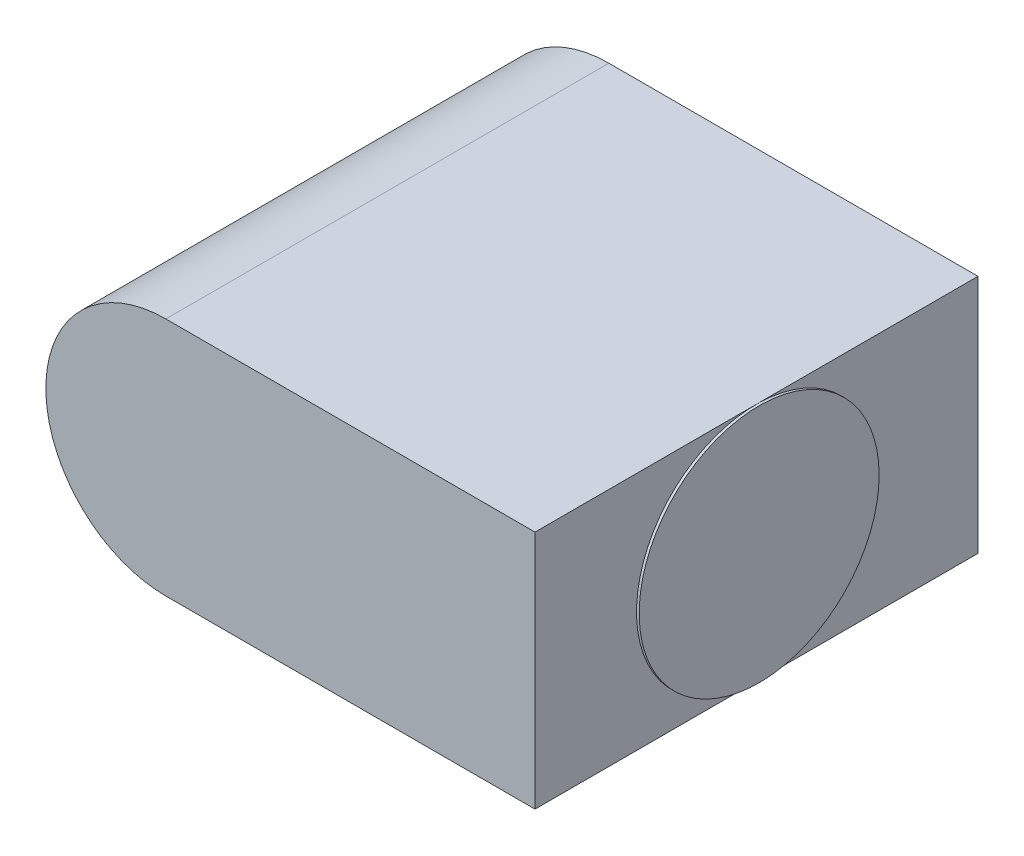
from build123d import *

# Parameters (mm, degrees)
BOSS_EXTRUDE1_DEPTH = 84
SKETCH2_R           = 22.75
BOSS_EXTRUDE2_DEPTH = 0.5


with BuildPart() as part:
    # Sketch1 → Boss-Extrude1 (new body)
    with BuildSketch(Plane.XY):
        with BuildLine():
            Line((0, 22.75), (70, 22.75))
            Line((70, 22.75), (70, -22.75))
            Line((70, -22.75), (0, -22.75))
            ThreePointArc((0, -22.75), (-22.75, 0), (0, 22.75))
        make_face()
    extrude(amount=-BOSS_EXTRUDE1_DEPTH)


with BuildPart() as body_2:
    # Sketch2 → Boss-Extrude2 (new body)
    with BuildSketch(Plane(origin=(70, 0, 0), x_dir=(0, 0, -1), z_dir=(1, 0, 0))):
        with Locations((42, 0)):
            Circle(SKETCH2_R)
    extrude(amount=BOSS_EXTRUDE2_DEPTH)


solid = Compound([part.part, body_2.part])
